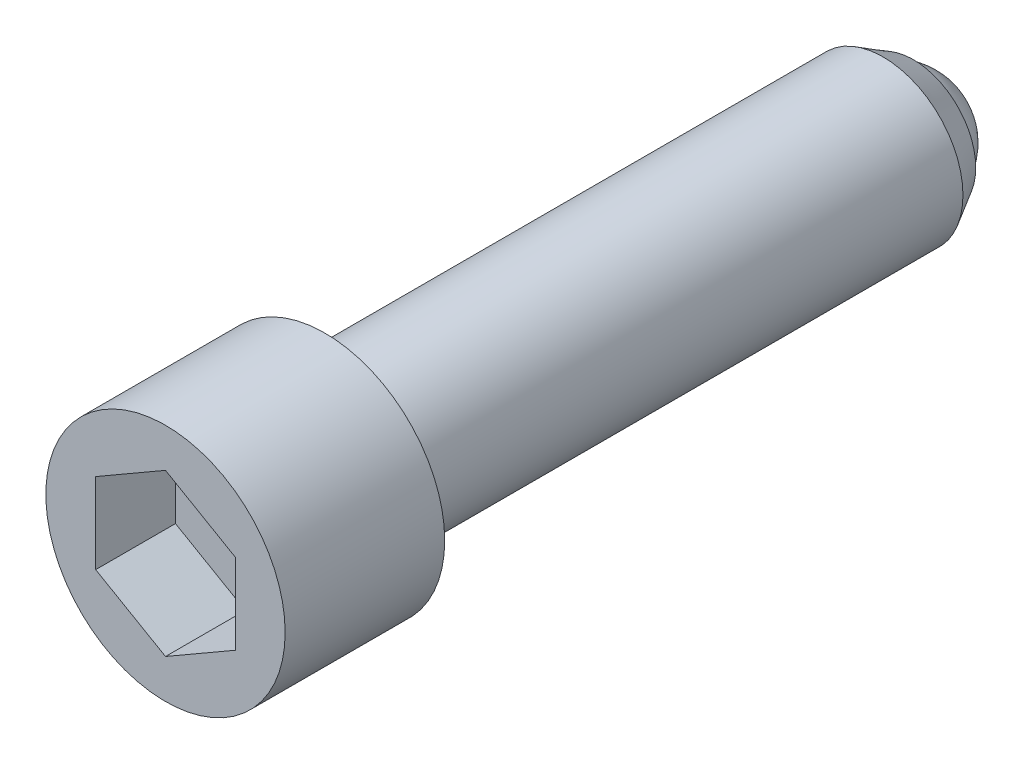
ISO-10303-21;
HEADER;
FILE_DESCRIPTION(('STEP AP214'),'2;1');
FILE_NAME('part.step','',(''),(''),'','','');
FILE_SCHEMA(('AUTOMOTIVE_DESIGN { 1 0 10303 214 1 1 1 1 }'));
ENDSEC;
DATA;
#1=APPLICATION_CONTEXT('core data for automotive mechanical design processes');
#2=APPLICATION_PROTOCOL_DEFINITION('international standard','automotive_design',2000,#1);
#3=PRODUCT_CONTEXT('',#1,'mechanical');
#4=PRODUCT('Part','Part','',(#3));
#5=PRODUCT_RELATED_PRODUCT_CATEGORY('part','',(#4));
#6=PRODUCT_DEFINITION_FORMATION('','',#4);
#7=PRODUCT_DEFINITION_CONTEXT('part definition',#1,'design');
#8=PRODUCT_DEFINITION('design','',#6,#7);
#9=PRODUCT_DEFINITION_SHAPE('','',#8);
#10=(LENGTH_UNIT() NAMED_UNIT(*) SI_UNIT(.MILLI.,.METRE.));
#11=(NAMED_UNIT(*) PLANE_ANGLE_UNIT() SI_UNIT($,.RADIAN.));
#12=(NAMED_UNIT(*) SI_UNIT($,.STERADIAN.) SOLID_ANGLE_UNIT());
#13=UNCERTAINTY_MEASURE_WITH_UNIT(LENGTH_MEASURE(1.E-05),#10,'distance_accuracy_value','');
#14=(GEOMETRIC_REPRESENTATION_CONTEXT(3) GLOBAL_UNCERTAINTY_ASSIGNED_CONTEXT((#13)) GLOBAL_UNIT_ASSIGNED_CONTEXT((#10,
#11,#12)) REPRESENTATION_CONTEXT('',''));
#15=CARTESIAN_POINT('',(0.,0.,0.));
#16=DIRECTION('',(0.,0.,1.));
#17=DIRECTION('',(1.,0.,0.));
#18=AXIS2_PLACEMENT_3D('',#15,#16,#17);
#19=CARTESIAN_POINT('',(0.,0.,6.));
#20=DIRECTION('',(0.,0.,-1.));
#21=DIRECTION('',(1.,0.,0.));
#22=AXIS2_PLACEMENT_3D('',#19,#20,#21);
#23=SPHERICAL_SURFACE('',#22,6.);
#24=CARTESIAN_POINT('',(0.,0.,4.));
#25=DIRECTION('',(0.,0.,-1.));
#26=DIRECTION('',(1.,0.,0.));
#27=AXIS2_PLACEMENT_3D('',#24,#25,#26);
#28=CIRCLE('',#27,5.65685424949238);
#29=CARTESIAN_POINT('',(5.65685424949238,0.,4.));
#30=VERTEX_POINT('',#29);
#31=EDGE_CURVE('E9',#30,#30,#28,.T.);
#32=ORIENTED_EDGE('',*,*,#31,.T.);
#33=EDGE_LOOP('',(#32));
#34=FACE_BOUND('',#33,.T.);
#35=ADVANCED_FACE('F14',(#34),#23,.T.);
#36=CARTESIAN_POINT('',(6.25,0.,4.));
#37=DIRECTION('',(0.,0.,1.));
#38=DIRECTION('',(-1.,0.,0.));
#39=AXIS2_PLACEMENT_3D('',#36,#37,#38);
#40=PLANE('',#39);
#41=ORIENTED_EDGE('',*,*,#31,.F.);
#42=EDGE_LOOP('',(#41));
#43=FACE_BOUND('',#42,.T.);
#44=CARTESIAN_POINT('',(0.,0.,4.));
#45=DIRECTION('',(0.,0.,-1.));
#46=DIRECTION('',(1.,0.,0.));
#47=AXIS2_PLACEMENT_3D('',#44,#45,#46);
#48=CIRCLE('',#47,6.25);
#49=CARTESIAN_POINT('',(6.25,0.,4.));
#50=VERTEX_POINT('',#49);
#51=EDGE_CURVE('E21',#50,#50,#48,.T.);
#52=ORIENTED_EDGE('',*,*,#51,.T.);
#53=EDGE_LOOP('',(#52));
#54=FACE_BOUND('',#53,.T.);
#55=ADVANCED_FACE('F135',(#43,#54),#40,.F.);
#56=CARTESIAN_POINT('',(0.,0.,4.));
#57=DIRECTION('',(0.,0.,1.));
#58=DIRECTION('',(-1.,0.,0.));
#59=AXIS2_PLACEMENT_3D('',#56,#57,#58);
#60=CONICAL_SURFACE('',#59,6.25,0.523598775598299);
#61=CARTESIAN_POINT('',(0.,0.,7.0310889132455));
#62=DIRECTION('',(0.,0.,-1.));
#63=DIRECTION('',(1.,0.,0.));
#64=AXIS2_PLACEMENT_3D('',#61,#62,#63);
#65=CIRCLE('',#64,8.);
#66=CARTESIAN_POINT('',(8.,0.,7.0310889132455));
#67=VERTEX_POINT('',#66);
#68=EDGE_CURVE('E130',#67,#67,#65,.T.);
#69=ORIENTED_EDGE('',*,*,#68,.T.);
#70=EDGE_LOOP('',(#69));
#71=FACE_BOUND('',#70,.T.);
#72=ORIENTED_EDGE('',*,*,#51,.F.);
#73=EDGE_LOOP('',(#72));
#74=FACE_BOUND('',#73,.T.);
#75=ADVANCED_FACE('F137',(#71,#74),#60,.T.);
#76=CARTESIAN_POINT('',(0.,0.,-27.));
#77=DIRECTION('',(0.,0.,-1.));
#78=DIRECTION('',(1.,0.,0.));
#79=AXIS2_PLACEMENT_3D('',#76,#77,#78);
#80=CYLINDRICAL_SURFACE('',#79,8.);
#81=CARTESIAN_POINT('',(0.,0.,63.));
#82=DIRECTION('',(0.,0.,-1.));
#83=DIRECTION('',(1.,0.,0.));
#84=AXIS2_PLACEMENT_3D('',#81,#82,#83);
#85=CIRCLE('',#84,8.);
#86=CARTESIAN_POINT('',(8.,0.,63.));
#87=VERTEX_POINT('',#86);
#88=EDGE_CURVE('E127',#87,#87,#85,.T.);
#89=ORIENTED_EDGE('',*,*,#88,.T.);
#90=EDGE_LOOP('',(#89));
#91=FACE_BOUND('',#90,.T.);
#92=ORIENTED_EDGE('',*,*,#68,.F.);
#93=EDGE_LOOP('',(#92));
#94=FACE_BOUND('',#93,.T.);
#95=ADVANCED_FACE('F139',(#91,#94),#80,.T.);
#96=CARTESIAN_POINT('',(8.,0.,63.));
#97=DIRECTION('',(0.,0.,-1.));
#98=DIRECTION('',(1.,0.,0.));
#99=AXIS2_PLACEMENT_3D('',#96,#97,#98);
#100=PLANE('',#99);
#101=CARTESIAN_POINT('',(0.,0.,63.));
#102=DIRECTION('',(0.,0.,-1.));
#103=DIRECTION('',(1.,0.,0.));
#104=AXIS2_PLACEMENT_3D('',#101,#102,#103);
#105=CIRCLE('',#104,12.);
#106=CARTESIAN_POINT('',(12.,0.,63.));
#107=VERTEX_POINT('',#106);
#108=EDGE_CURVE('E124',#107,#107,#105,.T.);
#109=ORIENTED_EDGE('',*,*,#108,.T.);
#110=EDGE_LOOP('',(#109));
#111=FACE_BOUND('',#110,.T.);
#112=ORIENTED_EDGE('',*,*,#88,.F.);
#113=EDGE_LOOP('',(#112));
#114=FACE_BOUND('',#113,.T.);
#115=ADVANCED_FACE('F147',(#111,#114),#100,.T.);
#116=CARTESIAN_POINT('',(0.,0.,-27.));
#117=DIRECTION('',(0.,0.,-1.));
#118=DIRECTION('',(1.,0.,0.));
#119=AXIS2_PLACEMENT_3D('',#116,#117,#118);
#120=CYLINDRICAL_SURFACE('',#119,12.);
#121=CARTESIAN_POINT('',(0.,0.,79.));
#122=DIRECTION('',(0.,0.,-1.));
#123=DIRECTION('',(1.,0.,0.));
#124=AXIS2_PLACEMENT_3D('',#121,#122,#123);
#125=CIRCLE('',#124,12.);
#126=CARTESIAN_POINT('',(12.,0.,79.));
#127=VERTEX_POINT('',#126);
#128=EDGE_CURVE('E121',#127,#127,#125,.T.);
#129=ORIENTED_EDGE('',*,*,#128,.T.);
#130=EDGE_LOOP('',(#129));
#131=FACE_BOUND('',#130,.T.);
#132=ORIENTED_EDGE('',*,*,#108,.F.);
#133=EDGE_LOOP('',(#132));
#134=FACE_BOUND('',#133,.T.);
#135=ADVANCED_FACE('F186',(#131,#134),#120,.T.);
#136=CARTESIAN_POINT('',(12.,0.,79.));
#137=DIRECTION('',(0.,0.,1.));
#138=DIRECTION('',(-1.,0.,0.));
#139=AXIS2_PLACEMENT_3D('',#136,#137,#138);
#140=PLANE('',#139);
#141=DIRECTION('',(-0.86602540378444,0.5,0.));
#142=VECTOR('',#141,1.);
#143=CARTESIAN_POINT('',(7.,4.04145188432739,79.));
#144=LINE('',#143,#142);
#145=CARTESIAN_POINT('',(7.,4.04145188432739,79.));
#146=VERTEX_POINT('',#145);
#147=CARTESIAN_POINT('',(0.,8.08290376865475,79.));
#148=VERTEX_POINT('',#147);
#149=EDGE_CURVE('E28',#146,#148,#144,.T.);
#150=ORIENTED_EDGE('',*,*,#149,.F.);
#151=DIRECTION('',(0.,1.,0.));
#152=VECTOR('',#151,1.);
#153=CARTESIAN_POINT('',(7.,-4.04145188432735,79.));
#154=LINE('',#153,#152);
#155=CARTESIAN_POINT('',(7.,-4.04145188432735,79.));
#156=VERTEX_POINT('',#155);
#157=EDGE_CURVE('E97',#156,#146,#154,.T.);
#158=ORIENTED_EDGE('',*,*,#157,.F.);
#159=DIRECTION('',(-0.866025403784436,-0.5,0.));
#160=VECTOR('',#159,1.);
#161=CARTESIAN_POINT('',(7.,-4.04145188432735,79.));
#162=LINE('',#161,#160);
#163=CARTESIAN_POINT('',(0.,-8.08290376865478,79.));
#164=VERTEX_POINT('',#163);
#165=EDGE_CURVE('E92',#156,#164,#162,.T.);
#166=ORIENTED_EDGE('',*,*,#165,.T.);
#167=DIRECTION('',(0.866025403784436,-0.5,0.));
#168=VECTOR('',#167,1.);
#169=CARTESIAN_POINT('',(-7.,-4.04145188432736,79.));
#170=LINE('',#169,#168);
#171=CARTESIAN_POINT('',(-7.,-4.04145188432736,79.));
#172=VERTEX_POINT('',#171);
#173=EDGE_CURVE('E90',#172,#164,#170,.T.);
#174=ORIENTED_EDGE('',*,*,#173,.F.);
#175=DIRECTION('',(0.,1.,0.));
#176=VECTOR('',#175,1.);
#177=CARTESIAN_POINT('',(-7.,-4.04145188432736,79.));
#178=LINE('',#177,#176);
#179=CARTESIAN_POINT('',(-7.,4.04145188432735,79.));
#180=VERTEX_POINT('',#179);
#181=EDGE_CURVE('E71',#172,#180,#178,.T.);
#182=ORIENTED_EDGE('',*,*,#181,.T.);
#183=DIRECTION('',(0.866025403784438,0.5,0.));
#184=VECTOR('',#183,1.);
#185=CARTESIAN_POINT('',(-7.,4.04145188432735,79.));
#186=LINE('',#185,#184);
#187=EDGE_CURVE('E82',#180,#148,#186,.T.);
#188=ORIENTED_EDGE('',*,*,#187,.T.);
#189=EDGE_LOOP('',(#150,#158,#166,#174,#182,#188));
#190=FACE_BOUND('',#189,.T.);
#191=ORIENTED_EDGE('',*,*,#128,.F.);
#192=EDGE_LOOP('',(#191));
#193=FACE_BOUND('',#192,.T.);
#194=ADVANCED_FACE('F86',(#190,#193),#140,.T.);
#195=CARTESIAN_POINT('',(7.,4.04145188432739,71.));
#196=DIRECTION('',(0.5,0.86602540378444,0.));
#197=DIRECTION('',(0.86602540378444,-0.5,0.));
#198=AXIS2_PLACEMENT_3D('',#195,#196,#197);
#199=PLANE('',#198);
#200=DIRECTION('',(0.,0.,1.));
#201=VECTOR('',#200,1.);
#202=CARTESIAN_POINT('',(7.,4.04145188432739,71.));
#203=LINE('',#202,#201);
#204=CARTESIAN_POINT('',(7.,4.04145188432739,71.));
#205=VERTEX_POINT('',#204);
#206=EDGE_CURVE('E35',#205,#146,#203,.T.);
#207=ORIENTED_EDGE('',*,*,#206,.T.);
#208=ORIENTED_EDGE('',*,*,#149,.T.);
#209=DIRECTION('',(0.,0.,1.));
#210=VECTOR('',#209,1.);
#211=CARTESIAN_POINT('',(0.,8.08290376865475,71.));
#212=LINE('',#211,#210);
#213=CARTESIAN_POINT('',(0.,8.08290376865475,71.));
#214=VERTEX_POINT('',#213);
#215=EDGE_CURVE('E79',#214,#148,#212,.T.);
#216=ORIENTED_EDGE('',*,*,#215,.F.);
#217=DIRECTION('',(-0.86602540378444,0.5,0.));
#218=VECTOR('',#217,1.);
#219=CARTESIAN_POINT('',(7.,4.04145188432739,71.));
#220=LINE('',#219,#218);
#221=EDGE_CURVE('E99',#205,#214,#220,.T.);
#222=ORIENTED_EDGE('',*,*,#221,.F.);
#223=EDGE_LOOP('',(#207,#208,#216,#222));
#224=FACE_BOUND('',#223,.T.);
#225=ADVANCED_FACE('F205',(#224),#199,.F.);
#226=CARTESIAN_POINT('',(7.,-4.04145188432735,71.));
#227=DIRECTION('',(1.,0.,0.));
#228=DIRECTION('',(0.,-1.,0.));
#229=AXIS2_PLACEMENT_3D('',#226,#227,#228);
#230=PLANE('',#229);
#231=DIRECTION('',(0.,0.,1.));
#232=VECTOR('',#231,1.);
#233=CARTESIAN_POINT('',(7.,-4.04145188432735,71.));
#234=LINE('',#233,#232);
#235=CARTESIAN_POINT('',(7.,-4.04145188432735,71.));
#236=VERTEX_POINT('',#235);
#237=EDGE_CURVE('E118',#236,#156,#234,.T.);
#238=ORIENTED_EDGE('',*,*,#237,.T.);
#239=ORIENTED_EDGE('',*,*,#157,.T.);
#240=ORIENTED_EDGE('',*,*,#206,.F.);
#241=DIRECTION('',(0.,1.,0.));
#242=VECTOR('',#241,1.);
#243=CARTESIAN_POINT('',(7.,-4.04145188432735,71.));
#244=LINE('',#243,#242);
#245=EDGE_CURVE('E111',#236,#205,#244,.T.);
#246=ORIENTED_EDGE('',*,*,#245,.F.);
#247=EDGE_LOOP('',(#238,#239,#240,#246));
#248=FACE_BOUND('',#247,.T.);
#249=ADVANCED_FACE('F214',(#248),#230,.F.);
#250=CARTESIAN_POINT('',(7.,-4.04145188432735,71.));
#251=DIRECTION('',(-0.5,0.866025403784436,0.));
#252=DIRECTION('',(0.866025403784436,0.5,0.));
#253=AXIS2_PLACEMENT_3D('',#250,#251,#252);
#254=PLANE('',#253);
#255=DIRECTION('',(0.,0.,1.));
#256=VECTOR('',#255,1.);
#257=CARTESIAN_POINT('',(0.,-8.08290376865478,71.));
#258=LINE('',#257,#256);
#259=CARTESIAN_POINT('',(0.,-8.08290376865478,71.));
#260=VERTEX_POINT('',#259);
#261=EDGE_CURVE('E116',#260,#164,#258,.T.);
#262=ORIENTED_EDGE('',*,*,#261,.T.);
#263=ORIENTED_EDGE('',*,*,#165,.F.);
#264=ORIENTED_EDGE('',*,*,#237,.F.);
#265=DIRECTION('',(-0.866025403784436,-0.5,0.));
#266=VECTOR('',#265,1.);
#267=CARTESIAN_POINT('',(7.,-4.04145188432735,71.));
#268=LINE('',#267,#266);
#269=EDGE_CURVE('E108',#236,#260,#268,.T.);
#270=ORIENTED_EDGE('',*,*,#269,.T.);
#271=EDGE_LOOP('',(#262,#263,#264,#270));
#272=FACE_BOUND('',#271,.T.);
#273=ADVANCED_FACE('F223',(#272),#254,.T.);
#274=CARTESIAN_POINT('',(-7.,-4.04145188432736,71.));
#275=DIRECTION('',(-0.5,-0.866025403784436,0.));
#276=DIRECTION('',(-0.866025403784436,0.5,0.));
#277=AXIS2_PLACEMENT_3D('',#274,#275,#276);
#278=PLANE('',#277);
#279=DIRECTION('',(0.,0.,1.));
#280=VECTOR('',#279,1.);
#281=CARTESIAN_POINT('',(-7.,-4.04145188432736,71.));
#282=LINE('',#281,#280);
#283=CARTESIAN_POINT('',(-7.,-4.04145188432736,71.));
#284=VERTEX_POINT('',#283);
#285=EDGE_CURVE('E78',#284,#172,#282,.T.);
#286=ORIENTED_EDGE('',*,*,#285,.T.);
#287=ORIENTED_EDGE('',*,*,#173,.T.);
#288=ORIENTED_EDGE('',*,*,#261,.F.);
#289=DIRECTION('',(0.866025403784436,-0.5,0.));
#290=VECTOR('',#289,1.);
#291=CARTESIAN_POINT('',(-7.,-4.04145188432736,71.));
#292=LINE('',#291,#290);
#293=EDGE_CURVE('E105',#284,#260,#292,.T.);
#294=ORIENTED_EDGE('',*,*,#293,.F.);
#295=EDGE_LOOP('',(#286,#287,#288,#294));
#296=FACE_BOUND('',#295,.T.);
#297=ADVANCED_FACE('F232',(#296),#278,.F.);
#298=CARTESIAN_POINT('',(-7.,-4.04145188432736,71.));
#299=DIRECTION('',(1.,0.,0.));
#300=DIRECTION('',(0.,-1.,0.));
#301=AXIS2_PLACEMENT_3D('',#298,#299,#300);
#302=PLANE('',#301);
#303=DIRECTION('',(0.,0.,1.));
#304=VECTOR('',#303,1.);
#305=CARTESIAN_POINT('',(-7.,4.04145188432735,71.));
#306=LINE('',#305,#304);
#307=CARTESIAN_POINT('',(-7.,4.04145188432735,71.));
#308=VERTEX_POINT('',#307);
#309=EDGE_CURVE('E67',#308,#180,#306,.T.);
#310=ORIENTED_EDGE('',*,*,#309,.T.);
#311=ORIENTED_EDGE('',*,*,#181,.F.);
#312=ORIENTED_EDGE('',*,*,#285,.F.);
#313=DIRECTION('',(0.,1.,0.));
#314=VECTOR('',#313,1.);
#315=CARTESIAN_POINT('',(-7.,-4.04145188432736,71.));
#316=LINE('',#315,#314);
#317=EDGE_CURVE('E74',#284,#308,#316,.T.);
#318=ORIENTED_EDGE('',*,*,#317,.T.);
#319=EDGE_LOOP('',(#310,#311,#312,#318));
#320=FACE_BOUND('',#319,.T.);
#321=ADVANCED_FACE('F69',(#320),#302,.T.);
#322=CARTESIAN_POINT('',(-7.,4.04145188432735,71.));
#323=DIRECTION('',(0.5,-0.866025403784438,0.));
#324=DIRECTION('',(-0.866025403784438,-0.5,0.));
#325=AXIS2_PLACEMENT_3D('',#322,#323,#324);
#326=PLANE('',#325);
#327=DIRECTION('',(0.866025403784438,0.5,0.));
#328=VECTOR('',#327,1.);
#329=CARTESIAN_POINT('',(-7.,4.04145188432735,71.));
#330=LINE('',#329,#328);
#331=EDGE_CURVE('E102',#308,#214,#330,.T.);
#332=ORIENTED_EDGE('',*,*,#331,.T.);
#333=ORIENTED_EDGE('',*,*,#215,.T.);
#334=ORIENTED_EDGE('',*,*,#187,.F.);
#335=ORIENTED_EDGE('',*,*,#309,.F.);
#336=EDGE_LOOP('',(#332,#333,#334,#335));
#337=FACE_BOUND('',#336,.T.);
#338=ADVANCED_FACE('F83',(#337),#326,.T.);
#339=CARTESIAN_POINT('',(14.,0.,71.));
#340=DIRECTION('',(0.,0.,1.));
#341=DIRECTION('',(-1.,0.,0.));
#342=AXIS2_PLACEMENT_3D('',#339,#340,#341);
#343=PLANE('',#342);
#344=ORIENTED_EDGE('',*,*,#221,.T.);
#345=ORIENTED_EDGE('',*,*,#331,.F.);
#346=ORIENTED_EDGE('',*,*,#317,.F.);
#347=ORIENTED_EDGE('',*,*,#293,.T.);
#348=ORIENTED_EDGE('',*,*,#269,.F.);
#349=ORIENTED_EDGE('',*,*,#245,.T.);
#350=EDGE_LOOP('',(#344,#345,#346,#347,#348,#349));
#351=FACE_BOUND('',#350,.T.);
#352=ADVANCED_FACE('F252',(#351),#343,.T.);
#353=CLOSED_SHELL('',(#35,#55,#75,#95,#115,#135,#194,#225,#249,#273,#297,#321,#338,#352));
#354=MANIFOLD_SOLID_BREP('B1',#353);
#355=ADVANCED_BREP_SHAPE_REPRESENTATION('',(#18,#354),#14);
#356=SHAPE_DEFINITION_REPRESENTATION(#9,#355);
ENDSEC;
END-ISO-10303-21;
